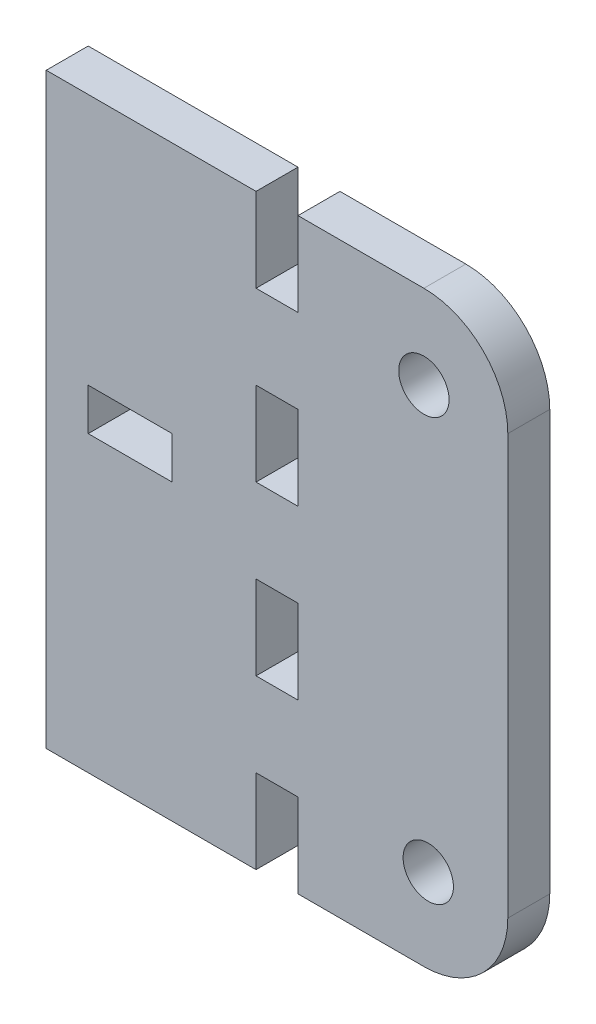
from build123d import *

# Parameters (mm, degrees)
ESQUISSE1_W             = 30
ESQUISSE1_H             = 70
BOSS_EXTRU_1_DEPTH      = 5
ESQUISSE2_W             = 10
ESQUISSE2_H             = 5
ENL_V_MAT_EXTRU_1_DEPTH = 5
ESQUISSE3_W             = 5
ESQUISSE3_H             = 10
ENL_V_MAT_EXTRU_2_DEPTH = 10
ESQUISSE4_W             = 5
ESQUISSE4_H             = 70
BOSS_EXTRU_2_DEPTH      = 25
ESQUISSE5_R             = 3
ENL_V_MAT_EXTRU_3_DEPTH = 5
CONG_1_R                = 10


with BuildPart() as part:
    # Esquisse1 → Boss.-Extru.1 (new body)
    with BuildSketch(Plane.XY):
        with Locations((-15, 0)):
            Rectangle(ESQUISSE1_W, ESQUISSE1_H)
    extrude(amount=BOSS_EXTRU_1_DEPTH)

    # Esquisse2 → Enl_v. mat.-Extru.1 (cut)
    with BuildSketch(Plane.XY.offset(5)):
        with Locations((-20, 2.5)):
            Rectangle(ESQUISSE2_W, ESQUISSE2_H)
    extrude(amount=-ENL_V_MAT_EXTRU_1_DEPTH, mode=Mode.SUBTRACT)

    # Esquisse3 → Enl_v. mat.-Extru.2 (cut)
    with BuildSketch(Plane.XY.offset(5)):
        with Locations((-2.5, -30)):
            Rectangle(ESQUISSE3_W, ESQUISSE3_H)
        with Locations((-2.5, -10)):
            Rectangle(ESQUISSE3_W, ESQUISSE3_H)
        with Locations((-2.5, 10)):
            Rectangle(ESQUISSE3_W, ESQUISSE3_H)
        with Locations((-2.5, 30)):
            Rectangle(ESQUISSE3_W, ESQUISSE3_H)
    extrude(amount=-ENL_V_MAT_EXTRU_2_DEPTH, mode=Mode.SUBTRACT)

    # Esquisse4 → Boss.-Extru.2 (add)
    with BuildSketch(Plane(origin=(0, 0, 0), x_dir=(0, 0, -1), z_dir=(1, 0, 0))):
        with Locations((-2.5, 0)):
            Rectangle(ESQUISSE4_W, ESQUISSE4_H)
    extrude(amount=BOSS_EXTRU_2_DEPTH)

    # Esquisse5 → Enl_v. mat.-Extru.3 (cut)
    with BuildSketch(Plane.XY.offset(5)):
        with Locations((15, 25)):
            Circle(ESQUISSE5_R)
        with Locations((15.520716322, -25)):
            Circle(ESQUISSE5_R)
    extrude(amount=-ENL_V_MAT_EXTRU_3_DEPTH, mode=Mode.SUBTRACT)

    # Cong_1
    cong_1_edges = [part.edges().sort_by_distance(p)[0] for p in [
        (25, -35, 2.5),
        (25, 35, 2.5),
    ]]
    fillet(cong_1_edges, radius=CONG_1_R)


solid = part.part
